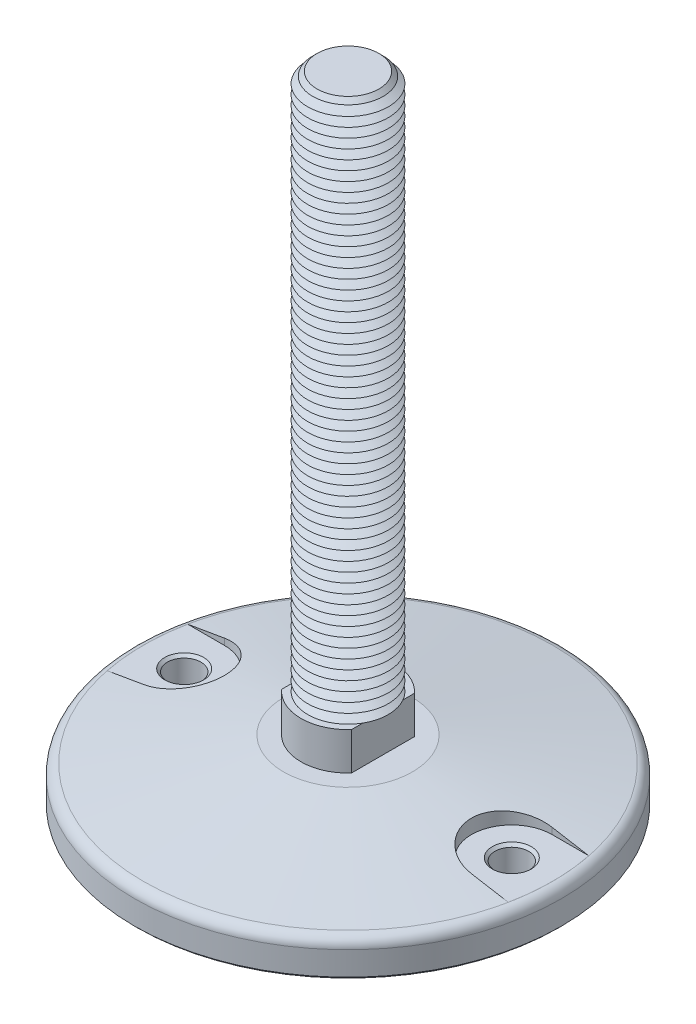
from build123d import *

# Parameters (mm, degrees)
FILLET1_R                = 4
SKETCH3_R                = 17.5
BOSS_EXTRUDE1_DEPTH      = 14
CUT_EXTRUDE1_START       = -14
CUT_EXTRUDE1_DEPTH       = 14
SKETCH5_R                = 15
BOSS_EXTRUDE2_DEPTH      = 200
CHAMFER1_SIZE            = 3.5
LPATTERN1_COUNT          = 57
LPATTERN1_PITCH          = 3.5
CUT_EXTRUDE4_DEPTH       = 9.2
SKETCH10_R               = 6.25
CUT_EXTRUDE5_DEPTH       = 13.8
CHAMFER2_SIZE            = 1
CHAMFER2_OF_MIRROR1_SIZE = 1
CHAMFER3_SIZE            = 1


with BuildPart() as part:
    # Sketch2 → Revolve1 (revolve)
    with BuildSketch(Plane(origin=(0, 0, 0), x_dir=(0, 0, -1), z_dir=(1, 0, 0)), mode=Mode.PRIVATE) as revolve1_sk:
        Polygon((0, 0), (-24, 0), (-79.5, -9.786147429), (-79.5, -23), (0, -23), align=None)
    revolve(revolve1_sk.sketch.rotate(Axis((0, 61.338865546, 0), (0, -1, 0)), 180), axis=Axis((0, 61.338865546, 0), (0, -1, 0)))

    # Fillet1
    fillet1_edges = [part.edges().sort_by_distance(p)[0] for p in [
        (0, -9.786147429, 79.5),
    ]]
    fillet(fillet1_edges, radius=FILLET1_R)

    # Sketch3 → Boss-Extrude1 (add)
    with BuildSketch(Plane(origin=(0, 0, 0), x_dir=(1, 0, 0), z_dir=(0, 1, 0))):
        with Locations(Location((0, 0, 0), (0, 0, 270))):
            Circle(SKETCH3_R)
    extrude(amount=BOSS_EXTRUDE1_DEPTH)

    # Sketch4 → Cut-Extrude1 (cut)
    with BuildSketch(Plane(origin=(0, 14, 0), x_dir=(1, 0, 0), z_dir=(0, 1, 0)).offset(CUT_EXTRUDE1_START)):
        with BuildLine():
            Line((-13, 11.715374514), (-13, -11.715374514))
            ThreePointArc((-13, -11.715374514), (-17.5, 0), (-13, 11.715374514))
        make_face()
        with BuildLine():
            Line((13, -11.715374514), (13, 11.715374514))
            ThreePointArc((13, 11.715374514), (17.5, 0), (13, -11.715374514))
        make_face()
    extrude(amount=CUT_EXTRUDE1_DEPTH, mode=Mode.SUBTRACT)

    # Sketch5 → Boss-Extrude2 (add)
    with BuildSketch(Plane(origin=(0, 14, 0), x_dir=(1, 0, 0), z_dir=(0, 1, 0))):
        with Locations(Location((0, 0, 0), (0, 0, 29.926434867))):
            Circle(SKETCH5_R)
    extrude(amount=BOSS_EXTRUDE2_DEPTH)

    # Chamfer1
    chamfer1_edges = [part.edges().sort_by_distance(p)[0] for p in [
        (-13, 214, 7.483314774),
    ]]
    chamfer(chamfer1_edges, length=CHAMFER1_SIZE)

    # Sketch6 → Cut-Revolve1 (revolve, cut)
    with BuildSketch(Plane(origin=(0, 0, 0), x_dir=(0, 0, -1), z_dir=(1, 0, 0))):
        Polygon((-15, 14), (-11.968911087, 15.75), (-15, 17.5), align=None)
    cut_revolve1 = revolve(axis=Axis((0, 61.338865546, 0), (0, -1, 0)), mode=Mode.SUBTRACT)

    # LPattern1: Cut-Revolve1 ×57
    with Locations(*[(0, i * LPATTERN1_PITCH, 0) for i in range(1, LPATTERN1_COUNT)]):
        add(cut_revolve1, mode=Mode.SUBTRACT)

    # Sketch8 → Cut-Extrude4 (cut)
    with BuildSketch(Plane(origin=(0, 0, 0), x_dir=(1, 0, 0), z_dir=(0, 1, 0))):
        with BuildLine():
            Line((-61, 15), (-74.703520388, 15))
            ThreePointArc((-74.703520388, 15), (-76.194592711, 0), (-74.703520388, -15))
            Line((-74.703520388, -15), (-61, -15))
            ThreePointArc((-61, -15), (-46, 0), (-61, 15))
        make_face()
    cut_extrude4 = extrude(amount=-CUT_EXTRUDE4_DEPTH, mode=Mode.SUBTRACT)

    # Sketch10 → Cut-Extrude5 (cut)
    with BuildSketch(Plane(origin=(0, -9.2, 0), x_dir=(1, 0, 0), z_dir=(0, 1, 0))):
        with Locations(Location((-61, 0, 0), (0, 0, 270))):
            Circle(SKETCH10_R)
    cut_extrude5 = extrude(amount=-CUT_EXTRUDE5_DEPTH, mode=Mode.SUBTRACT)

    # Chamfer2
    chamfer2_edges = [part.edges().sort_by_distance(p)[0] for p in [
        (-61, -9.2, -6.25),
        (-61, -23, -6.25),
    ]]
    chamfer(chamfer2_edges, length=CHAMFER2_SIZE)

    # Mirror1: Cut-Extrude4, Cut-Extrude5 across plane
    add(cut_extrude4.mirror(Plane(origin=(0, 0, 0), x_dir=(0, 0, 1), z_dir=(1, 0, 0))), mode=Mode.SUBTRACT)
    add(cut_extrude5.mirror(Plane(origin=(0, 0, 0), x_dir=(0, 0, 1), z_dir=(1, 0, 0))), mode=Mode.SUBTRACT)

    # Chamfer2 of Mirror1
    chamfer2_of_mirror1_edges = [part.edges().sort_by_distance(p)[0] for p in [
        (61, -9.2, -6.25),
        (61, -23, -6.25),
    ]]
    chamfer(chamfer2_of_mirror1_edges, length=CHAMFER2_OF_MIRROR1_SIZE)

    # Chamfer3
    chamfer3_edges = [part.edges().sort_by_distance(p)[0] for p in [
        (0, -23, 79.5),
    ]]
    chamfer(chamfer3_edges, length=CHAMFER3_SIZE)


solid = part.part
